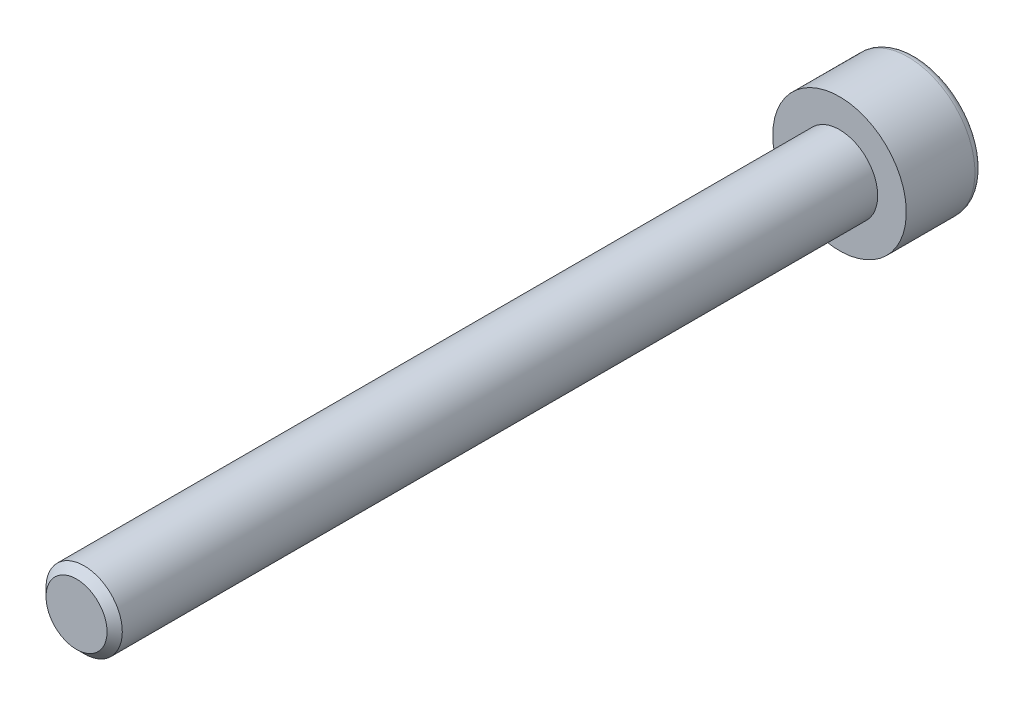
from build123d import *

# Parameters (mm, degrees)
ENLEV_MAT_EXTRU1_DEPTH = 2
ESQUISSE3_W            = 2
ESQUISSE3_H            = 40
CHANFREIN1_SIZE        = 0.4


with BuildPart() as part:
    # Esquisse1 → Base-R_volution (revolve)
    with BuildSketch(Plane(origin=(0, 0, 0), x_dir=(1, 0, 0), z_dir=(0, 1, 0)), mode=Mode.PRIVATE) as base_r_volution_sk:
        with BuildLine():
            Line((0, 0), (3.5, 0))
            Line((3.5, 0), (3.5, 3.6))
            ThreePointArc((3.5, 3.6), (3.382842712, 3.882842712), (3.1, 4))
            Line((3.1, 4), (0, 4))
            Line((0, 4), (0, 0))
        make_face()
    revolve(base_r_volution_sk.sketch.rotate(Axis((0, 0, 0), (0, 0, -1)), 180), axis=Axis((0, 0, 0), (0, 0, -1)))

    # Esquisse2 → enlev-mat-Extru1 (cut)
    with BuildSketch(Plane.XY.offset(-4)):
        Polygon((1.5, -0.866025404), (1.5, 0.866025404), (0, 1.732050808), (-1.5, 0.866025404), (-1.5, -0.866025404), (0, -1.732050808), align=None)
    extrude(amount=ENLEV_MAT_EXTRU1_DEPTH, mode=Mode.SUBTRACT)

    # Esquisse3 → Boss.-R_vol.1 (revolve)
    with BuildSketch(Plane(origin=(0, 0, 0), x_dir=(1, 0, 0), z_dir=(0, 1, 0))):
        with Locations((1, -20)):
            Rectangle(ESQUISSE3_W, ESQUISSE3_H)
    revolve(axis=Axis((0, 0, 0), (0, 0, 1)))

    # Chanfrein1
    chanfrein1_edges = [part.edges().sort_by_distance(p)[0] for p in [
        (-2, 0, 40),
    ]]
    chamfer(chanfrein1_edges, length=CHANFREIN1_SIZE)


solid = part.part
